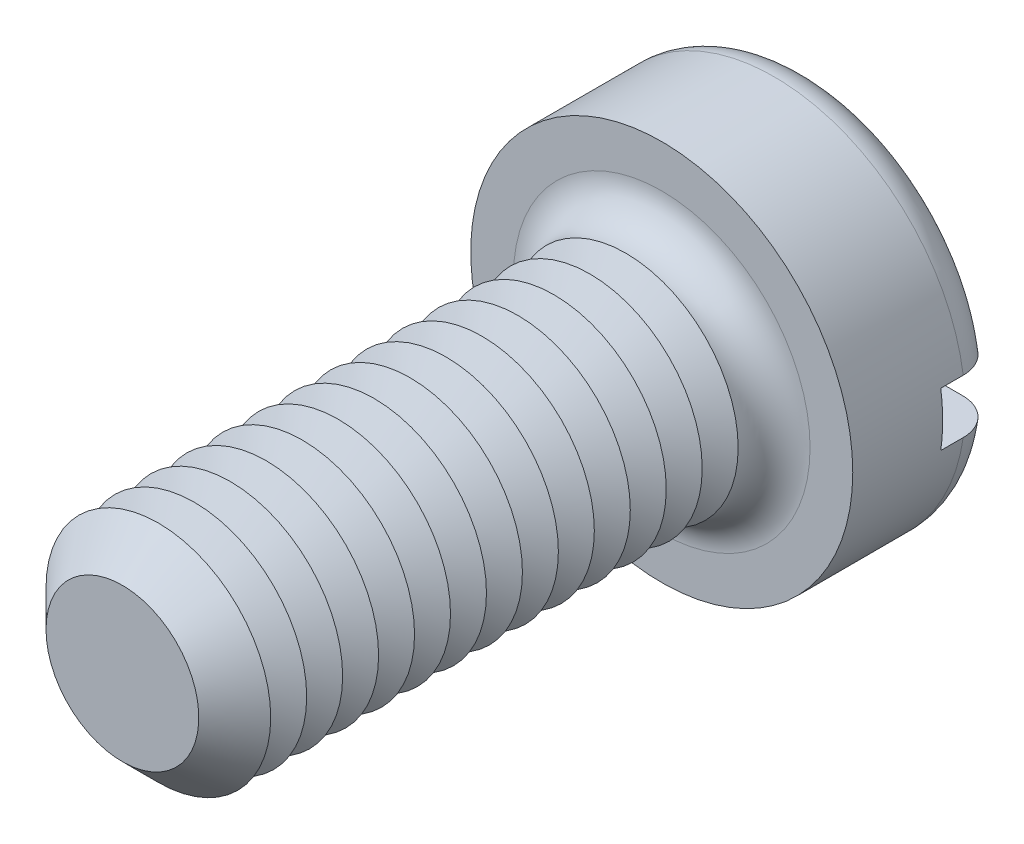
from build123d import *

# Parameters (mm, degrees)
SKETCH3_R           = 4.25
BOSS_EXTRUDE2_DEPTH = 3.3
SKETCH4_R           = 2.5
BOSS_EXTRUDE3_DEPTH = 12
FILLET1_R           = 0.8
CHAMFER1_SIZE       = 0.8
LPATTERN1_COUNT     = 13
LPATTERN1_PITCH     = 0.8
SKETCH8_W           = 8.5
SKETCH8_H           = 1.2
CUT_EXTRUDE1_DEPTH  = 1.3


with BuildPart() as part:
    # Sketch3 → Boss-Extrude2 (new body)
    with BuildSketch(Plane.XY):
        Circle(SKETCH3_R)
    extrude(amount=-BOSS_EXTRUDE2_DEPTH)

    # Sketch4 → Boss-Extrude3 (add)
    with BuildSketch(Plane.XY):
        Circle(SKETCH4_R)
    extrude(amount=BOSS_EXTRUDE3_DEPTH)

    # Fillet1
    fillet1_edges = [part.edges().sort_by_distance(p)[0] for p in [
        (-4.25, 0, -3.3),
        (-2.5, 0, 0),
    ]]
    fillet(fillet1_edges, radius=FILLET1_R)

    # Chamfer1
    chamfer1_edges = [part.edges().sort_by_distance(p)[0] for p in [
        (-2.5, 0, 12),
    ]]
    chamfer(chamfer1_edges, length=CHAMFER1_SIZE)

    # Sketch6 → Cut-Revolve1 (revolve, cut)
    with BuildSketch(Plane(origin=(0, 0, 0), x_dir=(0, 0, -1), z_dir=(1, 0, 0)), mode=Mode.PRIVATE) as cut_revolve1_sk:
        Polygon((-0.8, 2.5), (-1.2, 1.807179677), (-1.6, 2.5), align=None)
    cut_revolve1 = revolve(cut_revolve1_sk.sketch.rotate(Axis((0, 0, -1.694361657), (0, 0, 1)), 90), axis=Axis((0, 0, -1.694361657), (0, 0, 1)), mode=Mode.SUBTRACT)

    # LPattern1: Cut-Revolve1 ×13
    with Locations(*[(0, 0, i * LPATTERN1_PITCH) for i in range(1, LPATTERN1_COUNT)]):
        add(cut_revolve1, mode=Mode.SUBTRACT)

    # Sketch8 → Cut-Extrude1 (cut)
    with BuildSketch(Plane(origin=(0, 0, -3.3), x_dir=(-1, 0, 0), z_dir=(0, 0, -1))):
        Rectangle(SKETCH8_W, SKETCH8_H)
    extrude(amount=-CUT_EXTRUDE1_DEPTH, mode=Mode.SUBTRACT)


solid = part.part
